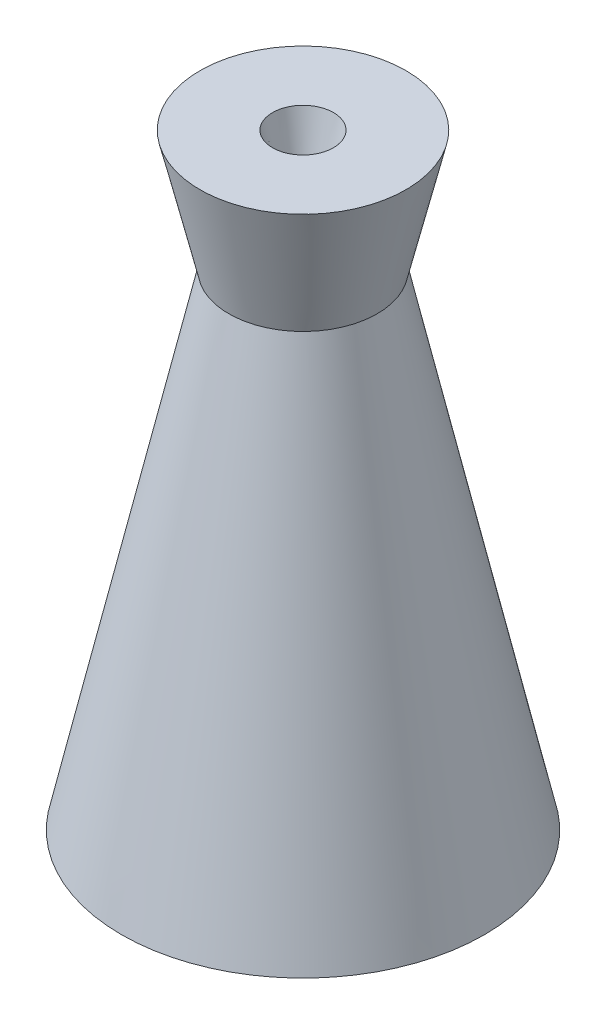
ISO-10303-21;
HEADER;
FILE_DESCRIPTION(('STEP AP214'),'2;1');
FILE_NAME('part.step','',(''),(''),'','','');
FILE_SCHEMA(('AUTOMOTIVE_DESIGN { 1 0 10303 214 1 1 1 1 }'));
ENDSEC;
DATA;
#1=APPLICATION_CONTEXT('core data for automotive mechanical design processes');
#2=APPLICATION_PROTOCOL_DEFINITION('international standard','automotive_design',2000,#1);
#3=PRODUCT_CONTEXT('',#1,'mechanical');
#4=PRODUCT('Part','Part','',(#3));
#5=PRODUCT_RELATED_PRODUCT_CATEGORY('part','',(#4));
#6=PRODUCT_DEFINITION_FORMATION('','',#4);
#7=PRODUCT_DEFINITION_CONTEXT('part definition',#1,'design');
#8=PRODUCT_DEFINITION('design','',#6,#7);
#9=PRODUCT_DEFINITION_SHAPE('','',#8);
#10=(LENGTH_UNIT() NAMED_UNIT(*) SI_UNIT(.MILLI.,.METRE.));
#11=(NAMED_UNIT(*) PLANE_ANGLE_UNIT() SI_UNIT($,.RADIAN.));
#12=(NAMED_UNIT(*) SI_UNIT($,.STERADIAN.) SOLID_ANGLE_UNIT());
#13=UNCERTAINTY_MEASURE_WITH_UNIT(LENGTH_MEASURE(1.E-05),#10,'distance_accuracy_value','');
#14=(GEOMETRIC_REPRESENTATION_CONTEXT(3) GLOBAL_UNCERTAINTY_ASSIGNED_CONTEXT((#13)) GLOBAL_UNIT_ASSIGNED_CONTEXT((#10,
#11,#12)) REPRESENTATION_CONTEXT('',''));
#15=CARTESIAN_POINT('',(0.,0.,0.));
#16=DIRECTION('',(0.,0.,1.));
#17=DIRECTION('',(1.,0.,0.));
#18=AXIS2_PLACEMENT_3D('',#15,#16,#17);
#19=CARTESIAN_POINT('',(0.,101.599451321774,0.));
#20=DIRECTION('',(0.,-1.,0.));
#21=DIRECTION('',(0.,0.,-1.));
#22=AXIS2_PLACEMENT_3D('',#19,#20,#21);
#23=CONICAL_SURFACE('',#22,0.333902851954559,0.224134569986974);
#24=CARTESIAN_POINT('',(0.,0.,0.));
#25=DIRECTION('',(0.,-1.,0.));
#26=DIRECTION('',(0.,0.,-1.));
#27=AXIS2_PLACEMENT_3D('',#24,#25,#26);
#28=CIRCLE('',#27,23.495);
#29=CARTESIAN_POINT('',(0.,0.,-23.495));
#30=VERTEX_POINT('',#29);
#31=EDGE_CURVE('E10',#30,#30,#28,.T.);
#32=CARTESIAN_POINT('',(0.,101.599451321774,0.));
#33=DIRECTION('',(0.,-1.,0.));
#34=DIRECTION('',(0.,0.,-1.));
#35=AXIS2_PLACEMENT_3D('',#32,#33,#34);
#36=CIRCLE('',#35,0.333902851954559);
#37=CARTESIAN_POINT('',(0.,101.599451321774,-0.333902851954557));
#38=VERTEX_POINT('',#37);
#39=EDGE_CURVE('E55',#38,#38,#36,.T.);
#40=CARTESIAN_POINT('',(0.,0.,-23.495));
#41=CARTESIAN_POINT('',(0.,1.05832761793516,-23.2537385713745));
#42=CARTESIAN_POINT('',(0.,2.1166552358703,-23.0124771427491));
#43=CARTESIAN_POINT('',(0.,4.23331047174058,-22.5299542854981));
#44=CARTESIAN_POINT('',(0.,5.29163808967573,-22.2886928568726));
#45=CARTESIAN_POINT('',(0.,7.40829332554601,-21.8061699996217));
#46=CARTESIAN_POINT('',(0.,8.46662094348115,-21.5649085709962));
#47=CARTESIAN_POINT('',(0.,10.5832761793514,-21.0823857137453));
#48=CARTESIAN_POINT('',(0.,11.6416037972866,-20.8411242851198));
#49=CARTESIAN_POINT('',(0.,13.7582590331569,-20.3586014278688));
#50=CARTESIAN_POINT('',(0.,14.816586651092,-20.1173399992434));
#51=CARTESIAN_POINT('',(0.,16.9332418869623,-19.6348171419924));
#52=CARTESIAN_POINT('',(0.,17.9915695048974,-19.393555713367));
#53=CARTESIAN_POINT('',(0.,20.1082247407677,-18.911032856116));
#54=CARTESIAN_POINT('',(0.,21.1665523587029,-18.6697714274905));
#55=CARTESIAN_POINT('',(0.,23.2832075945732,-18.1872485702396));
#56=CARTESIAN_POINT('',(0.,24.3415352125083,-17.9459871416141));
#57=CARTESIAN_POINT('',(0.,26.4581904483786,-17.4634642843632));
#58=CARTESIAN_POINT('',(0.,27.5165180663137,-17.2222028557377));
#59=CARTESIAN_POINT('',(0.,29.633173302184,-16.7396799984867));
#60=CARTESIAN_POINT('',(0.,30.6915009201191,-16.4984185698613));
#61=CARTESIAN_POINT('',(0.,32.8081561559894,-16.0158957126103));
#62=CARTESIAN_POINT('',(0.,33.8664837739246,-15.7746342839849));
#63=CARTESIAN_POINT('',(0.,35.9831390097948,-15.2921114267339));
#64=CARTESIAN_POINT('',(0.,37.04146662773,-15.0508499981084));
#65=CARTESIAN_POINT('',(0.,39.1581218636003,-14.5683271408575));
#66=CARTESIAN_POINT('',(0.,40.2164494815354,-14.327065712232));
#67=CARTESIAN_POINT('',(0.,42.3331047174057,-13.8445428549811));
#68=CARTESIAN_POINT('',(0.,43.3914323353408,-13.6032814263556));
#69=CARTESIAN_POINT('',(0.,45.5080875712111,-13.1207585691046));
#70=CARTESIAN_POINT('',(0.,46.5664151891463,-12.8794971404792));
#71=CARTESIAN_POINT('',(0.,48.6830704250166,-12.3969742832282));
#72=CARTESIAN_POINT('',(0.,49.7413980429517,-12.1557128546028));
#73=CARTESIAN_POINT('',(0.,51.858053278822,-11.6731899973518));
#74=CARTESIAN_POINT('',(0.,52.9163808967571,-11.4319285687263));
#75=CARTESIAN_POINT('',(0.,55.0330361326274,-10.9494057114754));
#76=CARTESIAN_POINT('',(0.,56.0913637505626,-10.7081442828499));
#77=CARTESIAN_POINT('',(0.,58.2080189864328,-10.225621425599));
#78=CARTESIAN_POINT('',(0.,59.266346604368,-9.98435999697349));
#79=CARTESIAN_POINT('',(0.,61.3830018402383,-9.50183713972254));
#80=CARTESIAN_POINT('',(0.,62.4413294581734,-9.26057571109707));
#81=CARTESIAN_POINT('',(0.,64.5579846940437,-8.77805285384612));
#82=CARTESIAN_POINT('',(0.,65.6163123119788,-8.53679142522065));
#83=CARTESIAN_POINT('',(0.,67.7329675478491,-8.0542685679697));
#84=CARTESIAN_POINT('',(0.,68.7912951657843,-7.81300713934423));
#85=CARTESIAN_POINT('',(0.,70.9079504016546,-7.33048428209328));
#86=CARTESIAN_POINT('',(0.,71.9662780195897,-7.08922285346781));
#87=CARTESIAN_POINT('',(0.,74.08293325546,-6.60669999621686));
#88=CARTESIAN_POINT('',(0.,75.1412608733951,-6.36543856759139));
#89=CARTESIAN_POINT('',(0.,77.2579161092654,-5.88291571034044));
#90=CARTESIAN_POINT('',(0.,78.3162437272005,-5.64165428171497));
#91=CARTESIAN_POINT('',(0.,80.4328989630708,-5.15913142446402));
#92=CARTESIAN_POINT('',(0.,81.491226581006,-4.91786999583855));
#93=CARTESIAN_POINT('',(0.,83.6078818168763,-4.4353471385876));
#94=CARTESIAN_POINT('',(0.,84.6662094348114,-4.19408570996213));
#95=CARTESIAN_POINT('',(0.,86.7828646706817,-3.71156285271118));
#96=CARTESIAN_POINT('',(0.,87.8411922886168,-3.47030142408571));
#97=CARTESIAN_POINT('',(0.,89.9578475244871,-2.98777856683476));
#98=CARTESIAN_POINT('',(0.,91.0161751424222,-2.74651713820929));
#99=CARTESIAN_POINT('',(0.,93.1328303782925,-2.26399428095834));
#100=CARTESIAN_POINT('',(0.,94.1911579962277,-2.02273285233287));
#101=CARTESIAN_POINT('',(0.,96.307813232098,-1.54020999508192));
#102=CARTESIAN_POINT('',(0.,97.3661408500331,-1.29894856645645));
#103=CARTESIAN_POINT('',(0.,99.4827960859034,-0.816425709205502));
#104=CARTESIAN_POINT('',(0.,100.541123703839,-0.575164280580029));
#105=CARTESIAN_POINT('',(0.,101.599451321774,-0.333902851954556));
#106=B_SPLINE_CURVE_WITH_KNOTS('',3,(#40,#41,#42,#43,#44,#45,#46,#47,#48,#49,#50,#51,#52,#53,
#54,#55,#56,#57,#58,#59,#60,#61,#62,#63,#64,#65,#66,#67,#68,#69,#70,#71,#72,#73,#74,#75,#76,#77,
#78,#79,#80,#81,#82,#83,#84,#85,#86,#87,#88,#89,#90,#91,#92,#93,#94,#95,#96,#97,#98,#99,#100,
#101,#102,#103,#104,#105),.UNSPECIFIED.,.F.,.F.,(4,2,2,2,2,2,2,2,2,2,2,2,2,2,2,2,2,2,2,2,2,2,2,
2,2,2,2,2,2,2,2,2,4),(0.,3.25643667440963,6.51287334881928,9.76931002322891,13.0257466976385,
16.2821833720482,19.5386200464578,22.7950567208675,26.0514933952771,29.3079300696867,
32.5643667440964,35.820803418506,39.0772400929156,42.3336767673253,45.5901134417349,
48.8465501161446,52.1029867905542,55.3594234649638,58.6158601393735,61.8722968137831,
65.1287334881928,68.3851701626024,71.641606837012,74.8980435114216,78.1544801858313,
81.4109168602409,84.6673535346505,87.9237902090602,91.1802268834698,94.4366635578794,
97.6931002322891,100.949536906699,104.205973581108),.UNSPECIFIED.);
#107=EDGE_CURVE('BSEAM33',#30,#38,#106,.T.);
#108=ORIENTED_EDGE('',*,*,#31,.T.);
#109=ORIENTED_EDGE('',*,*,#39,.F.);
#110=ORIENTED_EDGE('',*,*,#107,.T.);
#111=ORIENTED_EDGE('',*,*,#107,.F.);
#112=EDGE_LOOP('',(#108,#110,#109,#111));
#113=FACE_BOUND('',#112,.T.);
#114=ADVANCED_FACE('F33',(#113),#23,.F.);
#115=CARTESIAN_POINT('',(23.495,0.,0.));
#116=DIRECTION('',(0.,-1.,0.));
#117=DIRECTION('',(0.,0.,-1.));
#118=AXIS2_PLACEMENT_3D('',#115,#116,#117);
#119=PLANE('',#118);
#120=CARTESIAN_POINT('',(0.,0.,0.));
#121=DIRECTION('',(0.,-1.,0.));
#122=DIRECTION('',(0.,0.,-1.));
#123=AXIS2_PLACEMENT_3D('',#120,#121,#122);
#124=CIRCLE('',#123,38.1);
#125=CARTESIAN_POINT('',(0.,0.,-38.1));
#126=VERTEX_POINT('',#125);
#127=EDGE_CURVE('E39',#126,#126,#124,.T.);
#128=ORIENTED_EDGE('',*,*,#127,.T.);
#129=EDGE_LOOP('',(#128));
#130=FACE_BOUND('',#129,.T.);
#131=ORIENTED_EDGE('',*,*,#31,.F.);
#132=EDGE_LOOP('',(#131));
#133=FACE_BOUND('',#132,.T.);
#134=ADVANCED_FACE('F63',(#130,#133),#119,.T.);
#135=CARTESIAN_POINT('',(0.,0.,0.));
#136=DIRECTION('',(0.,-1.,0.));
#137=DIRECTION('',(0.,0.,-1.));
#138=AXIS2_PLACEMENT_3D('',#135,#136,#137);
#139=CONICAL_SURFACE('',#138,38.1,0.21818530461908);
#140=CARTESIAN_POINT('',(0.,101.599451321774,0.));
#141=DIRECTION('',(0.,-1.,0.));
#142=DIRECTION('',(0.,0.,-1.));
#143=AXIS2_PLACEMENT_3D('',#140,#141,#142);
#144=CIRCLE('',#143,15.5739028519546);
#145=CARTESIAN_POINT('',(0.,101.599451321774,-15.5739028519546));
#146=VERTEX_POINT('',#145);
#147=EDGE_CURVE('E43',#146,#146,#144,.T.);
#148=ORIENTED_EDGE('',*,*,#147,.T.);
#149=EDGE_LOOP('',(#148));
#150=FACE_BOUND('',#149,.T.);
#151=ORIENTED_EDGE('',*,*,#127,.F.);
#152=EDGE_LOOP('',(#151));
#153=FACE_BOUND('',#152,.T.);
#154=ADVANCED_FACE('F67',(#150,#153),#139,.T.);
#155=CARTESIAN_POINT('',(0.,101.599451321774,0.));
#156=DIRECTION('',(0.,1.,0.));
#157=DIRECTION('',(0.,0.,1.));
#158=AXIS2_PLACEMENT_3D('',#155,#156,#157);
#159=CONICAL_SURFACE('',#158,15.5739028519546,0.232601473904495);
#160=CARTESIAN_POINT('',(0.,127.19232851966,0.));
#161=DIRECTION('',(0.,-1.,0.));
#162=DIRECTION('',(0.,0.,-1.));
#163=AXIS2_PLACEMENT_3D('',#160,#161,#162);
#164=CIRCLE('',#163,21.6365774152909);
#165=CARTESIAN_POINT('',(0.,127.19232851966,-21.6365774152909));
#166=VERTEX_POINT('',#165);
#167=EDGE_CURVE('E47',#166,#166,#164,.T.);
#168=ORIENTED_EDGE('',*,*,#167,.T.);
#169=EDGE_LOOP('',(#168));
#170=FACE_BOUND('',#169,.T.);
#171=ORIENTED_EDGE('',*,*,#147,.F.);
#172=EDGE_LOOP('',(#171));
#173=FACE_BOUND('',#172,.T.);
#174=ADVANCED_FACE('F71',(#170,#173),#159,.T.);
#175=CARTESIAN_POINT('',(6.39657741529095,127.19232851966,0.));
#176=DIRECTION('',(0.,1.,0.));
#177=DIRECTION('',(0.,0.,1.));
#178=AXIS2_PLACEMENT_3D('',#175,#176,#177);
#179=PLANE('',#178);
#180=CARTESIAN_POINT('',(0.,127.19232851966,0.));
#181=DIRECTION('',(0.,-1.,0.));
#182=DIRECTION('',(0.,0.,-1.));
#183=AXIS2_PLACEMENT_3D('',#180,#181,#182);
#184=CIRCLE('',#183,6.39657741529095);
#185=CARTESIAN_POINT('',(0.,127.19232851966,-6.39657741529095));
#186=VERTEX_POINT('',#185);
#187=EDGE_CURVE('E52',#186,#186,#184,.T.);
#188=ORIENTED_EDGE('',*,*,#187,.T.);
#189=EDGE_LOOP('',(#188));
#190=FACE_BOUND('',#189,.T.);
#191=ORIENTED_EDGE('',*,*,#167,.F.);
#192=EDGE_LOOP('',(#191));
#193=FACE_BOUND('',#192,.T.);
#194=ADVANCED_FACE('F78',(#190,#193),#179,.T.);
#195=CARTESIAN_POINT('',(0.,127.19232851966,0.));
#196=DIRECTION('',(0.,1.,0.));
#197=DIRECTION('',(0.,0.,1.));
#198=AXIS2_PLACEMENT_3D('',#195,#196,#197);
#199=CONICAL_SURFACE('',#198,6.39657741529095,0.232601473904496);
#200=ORIENTED_EDGE('',*,*,#39,.T.);
#201=EDGE_LOOP('',(#200));
#202=FACE_BOUND('',#201,.T.);
#203=ORIENTED_EDGE('',*,*,#187,.F.);
#204=EDGE_LOOP('',(#203));
#205=FACE_BOUND('',#204,.T.);
#206=ADVANCED_FACE('F59',(#202,#205),#199,.F.);
#207=CLOSED_SHELL('',(#114,#134,#154,#174,#194,#206));
#208=MANIFOLD_SOLID_BREP('B2',#207);
#209=ADVANCED_BREP_SHAPE_REPRESENTATION('',(#18,#208),#14);
#210=SHAPE_DEFINITION_REPRESENTATION(#9,#209);
ENDSEC;
END-ISO-10303-21;
